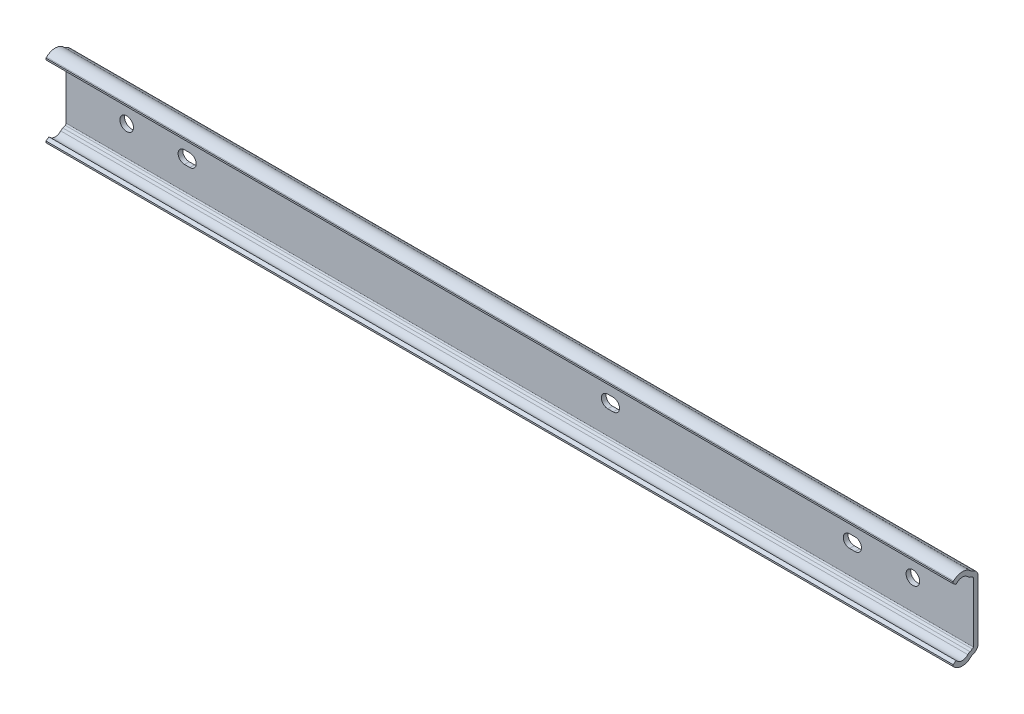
ISO-10303-21;
HEADER;
FILE_DESCRIPTION(('STEP AP214'),'2;1');
FILE_NAME('part.step','',(''),(''),'','','');
FILE_SCHEMA(('AUTOMOTIVE_DESIGN { 1 0 10303 214 1 1 1 1 }'));
ENDSEC;
DATA;
#1=APPLICATION_CONTEXT('core data for automotive mechanical design processes');
#2=APPLICATION_PROTOCOL_DEFINITION('international standard','automotive_design',2000,#1);
#3=PRODUCT_CONTEXT('',#1,'mechanical');
#4=PRODUCT('Part','Part','',(#3));
#5=PRODUCT_RELATED_PRODUCT_CATEGORY('part','',(#4));
#6=PRODUCT_DEFINITION_FORMATION('','',#4);
#7=PRODUCT_DEFINITION_CONTEXT('part definition',#1,'design');
#8=PRODUCT_DEFINITION('design','',#6,#7);
#9=PRODUCT_DEFINITION_SHAPE('','',#8);
#10=(LENGTH_UNIT() NAMED_UNIT(*) SI_UNIT(.MILLI.,.METRE.));
#11=(NAMED_UNIT(*) PLANE_ANGLE_UNIT() SI_UNIT($,.RADIAN.));
#12=(NAMED_UNIT(*) SI_UNIT($,.STERADIAN.) SOLID_ANGLE_UNIT());
#13=UNCERTAINTY_MEASURE_WITH_UNIT(LENGTH_MEASURE(1.E-05),#10,'distance_accuracy_value','');
#14=(GEOMETRIC_REPRESENTATION_CONTEXT(3) GLOBAL_UNCERTAINTY_ASSIGNED_CONTEXT((#13)) GLOBAL_UNIT_ASSIGNED_CONTEXT((#10,
#11,#12)) REPRESENTATION_CONTEXT('',''));
#15=CARTESIAN_POINT('',(0.,0.,0.));
#16=DIRECTION('',(0.,0.,1.));
#17=DIRECTION('',(1.,0.,0.));
#18=AXIS2_PLACEMENT_3D('',#15,#16,#17);
#19=CARTESIAN_POINT('',(-20.,9.85313395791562,1.54999999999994));
#20=DIRECTION('',(0.,0.,1.));
#21=DIRECTION('',(-1.,0.,0.));
#22=AXIS2_PLACEMENT_3D('',#19,#20,#21);
#23=PLANE('',#22);
#24=DIRECTION('',(0.,-1.,0.));
#25=VECTOR('',#24,1.);
#26=CARTESIAN_POINT('',(-20.,9.85313395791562,1.54999999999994));
#27=LINE('',#26,#25);
#28=CARTESIAN_POINT('',(-20.,9.85313395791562,1.54999999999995));
#29=VERTEX_POINT('',#28);
#30=CARTESIAN_POINT('',(-20.,-9.85313395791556,1.54999999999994));
#31=VERTEX_POINT('',#30);
#32=EDGE_CURVE('E510',#29,#31,#27,.T.);
#33=ORIENTED_EDGE('',*,*,#32,.T.);
#34=DIRECTION('',(1.,0.,0.));
#35=VECTOR('',#34,1.);
#36=CARTESIAN_POINT('',(-20.,-9.85313395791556,1.54999999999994));
#37=LINE('',#36,#35);
#38=CARTESIAN_POINT('',(280.,-9.85313395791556,1.54999999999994));
#39=VERTEX_POINT('',#38);
#40=EDGE_CURVE('E524',#31,#39,#37,.T.);
#41=ORIENTED_EDGE('',*,*,#40,.T.);
#42=DIRECTION('',(0.,-1.,0.));
#43=VECTOR('',#42,1.);
#44=CARTESIAN_POINT('',(280.,9.85313395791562,1.54999999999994));
#45=LINE('',#44,#43);
#46=CARTESIAN_POINT('',(280.,9.85313395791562,1.54999999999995));
#47=VERTEX_POINT('',#46);
#48=EDGE_CURVE('E435',#47,#39,#45,.T.);
#49=ORIENTED_EDGE('',*,*,#48,.F.);
#50=DIRECTION('',(1.,0.,0.));
#51=VECTOR('',#50,1.);
#52=CARTESIAN_POINT('',(-20.,9.85313395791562,1.54999999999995));
#53=LINE('',#52,#51);
#54=EDGE_CURVE('E526',#29,#47,#53,.T.);
#55=ORIENTED_EDGE('',*,*,#54,.F.);
#56=EDGE_LOOP('',(#33,#41,#49,#55));
#57=FACE_BOUND('',#56,.T.);
#58=CARTESIAN_POINT('',(20.9,0.,1.54999999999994));
#59=DIRECTION('',(0.,0.,1.));
#60=DIRECTION('',(-1.,0.,0.));
#61=AXIS2_PLACEMENT_3D('',#58,#59,#60);
#62=CIRCLE('',#61,2.1);
#63=CARTESIAN_POINT('',(20.9,-2.09999999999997,1.54999999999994));
#64=VERTEX_POINT('',#63);
#65=CARTESIAN_POINT('',(20.9,2.1,1.54999999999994));
#66=VERTEX_POINT('',#65);
#67=EDGE_CURVE('E31',#64,#66,#62,.T.);
#68=ORIENTED_EDGE('',*,*,#67,.F.);
#69=DIRECTION('',(1.,0.,0.));
#70=VECTOR('',#69,1.);
#71=CARTESIAN_POINT('',(20.9,-2.09999999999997,1.54999999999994));
#72=LINE('',#71,#70);
#73=CARTESIAN_POINT('',(19.1,-2.09999999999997,1.54999999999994));
#74=VERTEX_POINT('',#73);
#75=EDGE_CURVE('E277',#74,#64,#72,.T.);
#76=ORIENTED_EDGE('',*,*,#75,.F.);
#77=CARTESIAN_POINT('',(19.1,0.,1.54999999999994));
#78=DIRECTION('',(0.,0.,1.));
#79=DIRECTION('',(-1.,0.,0.));
#80=AXIS2_PLACEMENT_3D('',#77,#78,#79);
#81=CIRCLE('',#80,2.1);
#82=CARTESIAN_POINT('',(19.1,2.1,1.54999999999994));
#83=VERTEX_POINT('',#82);
#84=EDGE_CURVE('E262',#83,#74,#81,.T.);
#85=ORIENTED_EDGE('',*,*,#84,.F.);
#86=DIRECTION('',(-1.,0.,0.));
#87=VECTOR('',#86,1.);
#88=CARTESIAN_POINT('',(20.9,2.1,1.54999999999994));
#89=LINE('',#88,#87);
#90=EDGE_CURVE('E271',#66,#83,#89,.T.);
#91=ORIENTED_EDGE('',*,*,#90,.F.);
#92=EDGE_LOOP('',(#68,#76,#85,#91));
#93=FACE_BOUND('',#92,.T.);
#94=CARTESIAN_POINT('',(160.9,0.,1.54999999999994));
#95=DIRECTION('',(0.,0.,1.));
#96=DIRECTION('',(-1.,0.,0.));
#97=AXIS2_PLACEMENT_3D('',#94,#95,#96);
#98=CIRCLE('',#97,2.1);
#99=CARTESIAN_POINT('',(160.9,-2.09999999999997,1.54999999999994));
#100=VERTEX_POINT('',#99);
#101=CARTESIAN_POINT('',(160.9,2.10000000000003,1.54999999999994));
#102=VERTEX_POINT('',#101);
#103=EDGE_CURVE('E293',#100,#102,#98,.T.);
#104=ORIENTED_EDGE('',*,*,#103,.F.);
#105=DIRECTION('',(1.,0.,0.));
#106=VECTOR('',#105,1.);
#107=CARTESIAN_POINT('',(160.9,-2.09999999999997,1.54999999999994));
#108=LINE('',#107,#106);
#109=CARTESIAN_POINT('',(159.1,-2.09999999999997,1.54999999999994));
#110=VERTEX_POINT('',#109);
#111=EDGE_CURVE('E303',#110,#100,#108,.T.);
#112=ORIENTED_EDGE('',*,*,#111,.F.);
#113=CARTESIAN_POINT('',(159.1,0.,1.54999999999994));
#114=DIRECTION('',(0.,0.,1.));
#115=DIRECTION('',(-1.,0.,0.));
#116=AXIS2_PLACEMENT_3D('',#113,#114,#115);
#117=CIRCLE('',#116,2.1);
#118=CARTESIAN_POINT('',(159.1,2.10000000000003,1.54999999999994));
#119=VERTEX_POINT('',#118);
#120=EDGE_CURVE('E300',#119,#110,#117,.T.);
#121=ORIENTED_EDGE('',*,*,#120,.F.);
#122=DIRECTION('',(-1.,0.,0.));
#123=VECTOR('',#122,1.);
#124=CARTESIAN_POINT('',(160.9,2.10000000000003,1.54999999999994));
#125=LINE('',#124,#123);
#126=EDGE_CURVE('E297',#102,#119,#125,.T.);
#127=ORIENTED_EDGE('',*,*,#126,.F.);
#128=EDGE_LOOP('',(#104,#112,#121,#127));
#129=FACE_BOUND('',#128,.T.);
#130=CARTESIAN_POINT('',(260.,0.,1.54999999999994));
#131=DIRECTION('',(0.,0.,1.));
#132=DIRECTION('',(-1.,0.,0.));
#133=AXIS2_PLACEMENT_3D('',#130,#131,#132);
#134=CIRCLE('',#133,2.24999999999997);
#135=CARTESIAN_POINT('',(257.75,0.,1.54999999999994));
#136=VERTEX_POINT('',#135);
#137=EDGE_CURVE('E321',#136,#136,#134,.T.);
#138=ORIENTED_EDGE('',*,*,#137,.F.);
#139=EDGE_LOOP('',(#138));
#140=FACE_BOUND('',#139,.T.);
#141=CARTESIAN_POINT('',(0.,0.,1.54999999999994));
#142=DIRECTION('',(0.,0.,1.));
#143=DIRECTION('',(-1.,0.,0.));
#144=AXIS2_PLACEMENT_3D('',#141,#142,#143);
#145=CIRCLE('',#144,2.24999999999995);
#146=CARTESIAN_POINT('',(-2.24999999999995,0.,1.54999999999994));
#147=VERTEX_POINT('',#146);
#148=EDGE_CURVE('E333',#147,#147,#145,.T.);
#149=ORIENTED_EDGE('',*,*,#148,.F.);
#150=EDGE_LOOP('',(#149));
#151=FACE_BOUND('',#150,.T.);
#152=CARTESIAN_POINT('',(239.1,0.,1.54999999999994));
#153=DIRECTION('',(0.,0.,1.));
#154=DIRECTION('',(-1.,0.,0.));
#155=AXIS2_PLACEMENT_3D('',#152,#153,#154);
#156=CIRCLE('',#155,2.1);
#157=CARTESIAN_POINT('',(239.1,2.10000000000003,1.54999999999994));
#158=VERTEX_POINT('',#157);
#159=CARTESIAN_POINT('',(239.1,-2.09999999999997,1.54999999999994));
#160=VERTEX_POINT('',#159);
#161=EDGE_CURVE('E339',#158,#160,#156,.T.);
#162=ORIENTED_EDGE('',*,*,#161,.F.);
#163=DIRECTION('',(-1.,0.,0.));
#164=VECTOR('',#163,1.);
#165=CARTESIAN_POINT('',(240.9,2.10000000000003,1.54999999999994));
#166=LINE('',#165,#164);
#167=CARTESIAN_POINT('',(240.9,2.10000000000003,1.54999999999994));
#168=VERTEX_POINT('',#167);
#169=EDGE_CURVE('E347',#168,#158,#166,.T.);
#170=ORIENTED_EDGE('',*,*,#169,.F.);
#171=CARTESIAN_POINT('',(240.9,0.,1.54999999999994));
#172=DIRECTION('',(0.,0.,1.));
#173=DIRECTION('',(-1.,0.,0.));
#174=AXIS2_PLACEMENT_3D('',#171,#172,#173);
#175=CIRCLE('',#174,2.1);
#176=CARTESIAN_POINT('',(240.9,-2.09999999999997,1.54999999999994));
#177=VERTEX_POINT('',#176);
#178=EDGE_CURVE('E344',#177,#168,#175,.T.);
#179=ORIENTED_EDGE('',*,*,#178,.F.);
#180=DIRECTION('',(1.,0.,0.));
#181=VECTOR('',#180,1.);
#182=CARTESIAN_POINT('',(240.9,-2.09999999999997,1.54999999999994));
#183=LINE('',#182,#181);
#184=EDGE_CURVE('E341',#160,#177,#183,.T.);
#185=ORIENTED_EDGE('',*,*,#184,.F.);
#186=EDGE_LOOP('',(#162,#170,#179,#185));
#187=FACE_BOUND('',#186,.T.);
#188=ADVANCED_FACE('F14',(#57,#93,#129,#140,#151,#187),#23,.T.);
#189=CARTESIAN_POINT('',(-20.,9.85313395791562,0.));
#190=DIRECTION('',(0.,0.,-1.));
#191=DIRECTION('',(1.,0.,0.));
#192=AXIS2_PLACEMENT_3D('',#189,#190,#191);
#193=PLANE('',#192);
#194=DIRECTION('',(0.,1.,0.));
#195=VECTOR('',#194,1.);
#196=CARTESIAN_POINT('',(-20.,9.85313395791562,0.));
#197=LINE('',#196,#195);
#198=CARTESIAN_POINT('',(-20.,-9.85313395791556,0.));
#199=VERTEX_POINT('',#198);
#200=CARTESIAN_POINT('',(-20.,9.85313395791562,0.));
#201=VERTEX_POINT('',#200);
#202=EDGE_CURVE('E473',#199,#201,#197,.T.);
#203=ORIENTED_EDGE('',*,*,#202,.T.);
#204=DIRECTION('',(1.,0.,0.));
#205=VECTOR('',#204,1.);
#206=CARTESIAN_POINT('',(-20.,9.85313395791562,0.));
#207=LINE('',#206,#205);
#208=CARTESIAN_POINT('',(280.,9.85313395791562,0.));
#209=VERTEX_POINT('',#208);
#210=EDGE_CURVE('E551',#201,#209,#207,.T.);
#211=ORIENTED_EDGE('',*,*,#210,.T.);
#212=DIRECTION('',(0.,1.,0.));
#213=VECTOR('',#212,1.);
#214=CARTESIAN_POINT('',(280.,9.85313395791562,0.));
#215=LINE('',#214,#213);
#216=CARTESIAN_POINT('',(280.,-9.85313395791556,0.));
#217=VERTEX_POINT('',#216);
#218=EDGE_CURVE('E397',#217,#209,#215,.T.);
#219=ORIENTED_EDGE('',*,*,#218,.F.);
#220=DIRECTION('',(1.,0.,0.));
#221=VECTOR('',#220,1.);
#222=CARTESIAN_POINT('',(-20.,-9.85313395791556,0.));
#223=LINE('',#222,#221);
#224=EDGE_CURVE('E553',#199,#217,#223,.T.);
#225=ORIENTED_EDGE('',*,*,#224,.F.);
#226=EDGE_LOOP('',(#203,#211,#219,#225));
#227=FACE_BOUND('',#226,.T.);
#228=CARTESIAN_POINT('',(20.9,0.,0.));
#229=DIRECTION('',(0.,0.,1.));
#230=DIRECTION('',(-1.,0.,0.));
#231=AXIS2_PLACEMENT_3D('',#228,#229,#230);
#232=CIRCLE('',#231,2.1);
#233=CARTESIAN_POINT('',(20.9,-2.09999999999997,0.));
#234=VERTEX_POINT('',#233);
#235=CARTESIAN_POINT('',(20.9,2.1,0.));
#236=VERTEX_POINT('',#235);
#237=EDGE_CURVE('E279',#234,#236,#232,.T.);
#238=ORIENTED_EDGE('',*,*,#237,.T.);
#239=DIRECTION('',(-1.,0.,0.));
#240=VECTOR('',#239,1.);
#241=CARTESIAN_POINT('',(20.9,2.1,0.));
#242=LINE('',#241,#240);
#243=CARTESIAN_POINT('',(19.1,2.1,0.));
#244=VERTEX_POINT('',#243);
#245=EDGE_CURVE('E285',#236,#244,#242,.T.);
#246=ORIENTED_EDGE('',*,*,#245,.T.);
#247=CARTESIAN_POINT('',(19.1,0.,0.));
#248=DIRECTION('',(0.,0.,1.));
#249=DIRECTION('',(-1.,0.,0.));
#250=AXIS2_PLACEMENT_3D('',#247,#248,#249);
#251=CIRCLE('',#250,2.1);
#252=CARTESIAN_POINT('',(19.1,-2.09999999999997,0.));
#253=VERTEX_POINT('',#252);
#254=EDGE_CURVE('E39',#244,#253,#251,.T.);
#255=ORIENTED_EDGE('',*,*,#254,.T.);
#256=DIRECTION('',(1.,0.,0.));
#257=VECTOR('',#256,1.);
#258=CARTESIAN_POINT('',(20.9,-2.09999999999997,0.));
#259=LINE('',#258,#257);
#260=EDGE_CURVE('E288',#253,#234,#259,.T.);
#261=ORIENTED_EDGE('',*,*,#260,.T.);
#262=EDGE_LOOP('',(#238,#246,#255,#261));
#263=FACE_BOUND('',#262,.T.);
#264=CARTESIAN_POINT('',(160.9,0.,0.));
#265=DIRECTION('',(0.,0.,1.));
#266=DIRECTION('',(-1.,0.,0.));
#267=AXIS2_PLACEMENT_3D('',#264,#265,#266);
#268=CIRCLE('',#267,2.1);
#269=CARTESIAN_POINT('',(160.9,-2.09999999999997,0.));
#270=VERTEX_POINT('',#269);
#271=CARTESIAN_POINT('',(160.9,2.10000000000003,0.));
#272=VERTEX_POINT('',#271);
#273=EDGE_CURVE('E306',#270,#272,#268,.T.);
#274=ORIENTED_EDGE('',*,*,#273,.T.);
#275=DIRECTION('',(-1.,0.,0.));
#276=VECTOR('',#275,1.);
#277=CARTESIAN_POINT('',(160.9,2.10000000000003,0.));
#278=LINE('',#277,#276);
#279=CARTESIAN_POINT('',(159.1,2.10000000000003,0.));
#280=VERTEX_POINT('',#279);
#281=EDGE_CURVE('E309',#272,#280,#278,.T.);
#282=ORIENTED_EDGE('',*,*,#281,.T.);
#283=CARTESIAN_POINT('',(159.1,0.,0.));
#284=DIRECTION('',(0.,0.,1.));
#285=DIRECTION('',(-1.,0.,0.));
#286=AXIS2_PLACEMENT_3D('',#283,#284,#285);
#287=CIRCLE('',#286,2.1);
#288=CARTESIAN_POINT('',(159.1,-2.09999999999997,0.));
#289=VERTEX_POINT('',#288);
#290=EDGE_CURVE('E312',#280,#289,#287,.T.);
#291=ORIENTED_EDGE('',*,*,#290,.T.);
#292=DIRECTION('',(1.,0.,0.));
#293=VECTOR('',#292,1.);
#294=CARTESIAN_POINT('',(160.9,-2.09999999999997,0.));
#295=LINE('',#294,#293);
#296=EDGE_CURVE('E315',#289,#270,#295,.T.);
#297=ORIENTED_EDGE('',*,*,#296,.T.);
#298=EDGE_LOOP('',(#274,#282,#291,#297));
#299=FACE_BOUND('',#298,.T.);
#300=CARTESIAN_POINT('',(260.,0.,0.));
#301=DIRECTION('',(0.,0.,1.));
#302=DIRECTION('',(-1.,0.,0.));
#303=AXIS2_PLACEMENT_3D('',#300,#301,#302);
#304=CIRCLE('',#303,2.24999999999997);
#305=CARTESIAN_POINT('',(257.75,0.,0.));
#306=VERTEX_POINT('',#305);
#307=EDGE_CURVE('E330',#306,#306,#304,.T.);
#308=ORIENTED_EDGE('',*,*,#307,.T.);
#309=EDGE_LOOP('',(#308));
#310=FACE_BOUND('',#309,.T.);
#311=CARTESIAN_POINT('',(0.,0.,0.));
#312=DIRECTION('',(0.,0.,1.));
#313=DIRECTION('',(-1.,0.,0.));
#314=AXIS2_PLACEMENT_3D('',#311,#312,#313);
#315=CIRCLE('',#314,2.24999999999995);
#316=CARTESIAN_POINT('',(-2.24999999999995,0.,0.));
#317=VERTEX_POINT('',#316);
#318=EDGE_CURVE('E336',#317,#317,#315,.T.);
#319=ORIENTED_EDGE('',*,*,#318,.T.);
#320=EDGE_LOOP('',(#319));
#321=FACE_BOUND('',#320,.T.);
#322=CARTESIAN_POINT('',(239.1,0.,0.));
#323=DIRECTION('',(0.,0.,1.));
#324=DIRECTION('',(-1.,0.,0.));
#325=AXIS2_PLACEMENT_3D('',#322,#323,#324);
#326=CIRCLE('',#325,2.1);
#327=CARTESIAN_POINT('',(239.1,2.10000000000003,0.));
#328=VERTEX_POINT('',#327);
#329=CARTESIAN_POINT('',(239.1,-2.09999999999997,0.));
#330=VERTEX_POINT('',#329);
#331=EDGE_CURVE('E350',#328,#330,#326,.T.);
#332=ORIENTED_EDGE('',*,*,#331,.T.);
#333=DIRECTION('',(1.,0.,0.));
#334=VECTOR('',#333,1.);
#335=CARTESIAN_POINT('',(240.9,-2.09999999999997,0.));
#336=LINE('',#335,#334);
#337=CARTESIAN_POINT('',(240.9,-2.09999999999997,0.));
#338=VERTEX_POINT('',#337);
#339=EDGE_CURVE('E353',#330,#338,#336,.T.);
#340=ORIENTED_EDGE('',*,*,#339,.T.);
#341=CARTESIAN_POINT('',(240.9,0.,0.));
#342=DIRECTION('',(0.,0.,1.));
#343=DIRECTION('',(-1.,0.,0.));
#344=AXIS2_PLACEMENT_3D('',#341,#342,#343);
#345=CIRCLE('',#344,2.1);
#346=CARTESIAN_POINT('',(240.9,2.10000000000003,0.));
#347=VERTEX_POINT('',#346);
#348=EDGE_CURVE('E356',#338,#347,#345,.T.);
#349=ORIENTED_EDGE('',*,*,#348,.T.);
#350=DIRECTION('',(-1.,0.,0.));
#351=VECTOR('',#350,1.);
#352=CARTESIAN_POINT('',(240.9,2.10000000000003,0.));
#353=LINE('',#352,#351);
#354=EDGE_CURVE('E359',#347,#328,#353,.T.);
#355=ORIENTED_EDGE('',*,*,#354,.T.);
#356=EDGE_LOOP('',(#332,#340,#349,#355));
#357=FACE_BOUND('',#356,.T.);
#358=ADVANCED_FACE('F618',(#227,#263,#299,#310,#321,#357),#193,.T.);
#359=CARTESIAN_POINT('',(-20.,-9.46999976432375,5.19000022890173));
#360=DIRECTION('',(1.,0.,0.));
#361=DIRECTION('',(0.,0.,1.));
#362=AXIS2_PLACEMENT_3D('',#359,#360,#361);
#363=CYLINDRICAL_SURFACE('',#362,2.47999999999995);
#364=CARTESIAN_POINT('',(280.,-9.46999976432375,5.19000022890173));
#365=DIRECTION('',(-1.,0.,0.));
#366=DIRECTION('',(0.,0.,1.));
#367=AXIS2_PLACEMENT_3D('',#364,#365,#366);
#368=CIRCLE('',#367,2.47999999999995);
#369=CARTESIAN_POINT('',(280.,-11.1527317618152,3.3682392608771));
#370=VERTEX_POINT('',#369);
#371=CARTESIAN_POINT('',(280.,-11.2236245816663,6.94362504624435));
#372=VERTEX_POINT('',#371);
#373=EDGE_CURVE('E365',#370,#372,#368,.T.);
#374=ORIENTED_EDGE('',*,*,#373,.F.);
#375=DIRECTION('',(1.,0.,0.));
#376=VECTOR('',#375,1.);
#377=CARTESIAN_POINT('',(-20.,-11.1527317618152,3.3682392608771));
#378=LINE('',#377,#376);
#379=CARTESIAN_POINT('',(-20.,-11.1527317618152,3.3682392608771));
#380=VERTEX_POINT('',#379);
#381=EDGE_CURVE('E9',#380,#370,#378,.T.);
#382=ORIENTED_EDGE('',*,*,#381,.F.);
#383=CARTESIAN_POINT('',(-20.,-9.46999976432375,5.19000022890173));
#384=DIRECTION('',(-1.,0.,0.));
#385=DIRECTION('',(0.,0.,1.));
#386=AXIS2_PLACEMENT_3D('',#383,#384,#385);
#387=CIRCLE('',#386,2.47999999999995);
#388=CARTESIAN_POINT('',(-20.,-11.2236245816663,6.94362504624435));
#389=VERTEX_POINT('',#388);
#390=EDGE_CURVE('E447',#380,#389,#387,.T.);
#391=ORIENTED_EDGE('',*,*,#390,.T.);
#392=DIRECTION('',(1.,0.,0.));
#393=VECTOR('',#392,1.);
#394=CARTESIAN_POINT('',(-20.,-11.2236245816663,6.94362504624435));
#395=LINE('',#394,#393);
#396=EDGE_CURVE('E18',#389,#372,#395,.T.);
#397=ORIENTED_EDGE('',*,*,#396,.T.);
#398=EDGE_LOOP('',(#374,#382,#391,#397));
#399=FACE_BOUND('',#398,.T.);
#400=ADVANCED_FACE('F16',(#399),#363,.F.);
#401=CARTESIAN_POINT('',(-20.,-12.5436997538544,1.86234824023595));
#402=DIRECTION('',(1.,0.,0.));
#403=DIRECTION('',(0.,0.,1.));
#404=AXIS2_PLACEMENT_3D('',#401,#402,#403);
#405=CYLINDRICAL_SURFACE('',#404,2.04999993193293);
#406=CARTESIAN_POINT('',(280.,-12.5436997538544,1.86234824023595));
#407=DIRECTION('',(1.,0.,0.));
#408=DIRECTION('',(0.,0.,1.));
#409=AXIS2_PLACEMENT_3D('',#406,#407,#408);
#410=CIRCLE('',#409,2.04999993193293);
#411=CARTESIAN_POINT('',(280.,-10.6566648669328,2.66334702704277));
#412=VERTEX_POINT('',#411);
#413=EDGE_CURVE('E444',#412,#370,#410,.T.);
#414=ORIENTED_EDGE('',*,*,#413,.F.);
#415=DIRECTION('',(1.,0.,0.));
#416=VECTOR('',#415,1.);
#417=CARTESIAN_POINT('',(-20.,-10.6566648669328,2.66334702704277));
#418=LINE('',#417,#416);
#419=CARTESIAN_POINT('',(-20.,-10.6566648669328,2.66334702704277));
#420=VERTEX_POINT('',#419);
#421=EDGE_CURVE('E23',#420,#412,#418,.T.);
#422=ORIENTED_EDGE('',*,*,#421,.F.);
#423=CARTESIAN_POINT('',(-20.,-12.5436997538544,1.86234824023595));
#424=DIRECTION('',(1.,0.,0.));
#425=DIRECTION('',(0.,0.,1.));
#426=AXIS2_PLACEMENT_3D('',#423,#424,#425);
#427=CIRCLE('',#426,2.04999993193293);
#428=EDGE_CURVE('E518',#420,#380,#427,.T.);
#429=ORIENTED_EDGE('',*,*,#428,.T.);
#430=ORIENTED_EDGE('',*,*,#381,.T.);
#431=EDGE_LOOP('',(#414,#422,#429,#430));
#432=FACE_BOUND('',#431,.T.);
#433=ADVANCED_FACE('F581',(#432),#405,.T.);
#434=CARTESIAN_POINT('',(-20.,-10.6566648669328,2.66334702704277));
#435=DIRECTION('',(0.,0.920504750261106,0.390731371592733));
#436=DIRECTION('',(0.,-0.390731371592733,0.920504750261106));
#437=AXIS2_PLACEMENT_3D('',#434,#435,#436);
#438=PLANE('',#437);
#439=DIRECTION('',(0.,-0.390731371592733,0.920504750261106));
#440=VECTOR('',#439,1.);
#441=CARTESIAN_POINT('',(280.,-10.6566648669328,2.66334702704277));
#442=LINE('',#441,#440);
#443=CARTESIAN_POINT('',(280.,-10.3133868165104,1.85463521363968));
#444=VERTEX_POINT('',#443);
#445=EDGE_CURVE('E441',#444,#412,#442,.T.);
#446=ORIENTED_EDGE('',*,*,#445,.F.);
#447=DIRECTION('',(1.,0.,0.));
#448=VECTOR('',#447,1.);
#449=CARTESIAN_POINT('',(-20.,-10.3133868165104,1.85463521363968));
#450=LINE('',#449,#448);
#451=CARTESIAN_POINT('',(-20.,-10.3133868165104,1.85463521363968));
#452=VERTEX_POINT('',#451);
#453=EDGE_CURVE('E522',#452,#444,#450,.T.);
#454=ORIENTED_EDGE('',*,*,#453,.F.);
#455=DIRECTION('',(0.,-0.390731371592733,0.920504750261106));
#456=VECTOR('',#455,1.);
#457=CARTESIAN_POINT('',(-20.,-10.6566648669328,2.66334702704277));
#458=LINE('',#457,#456);
#459=EDGE_CURVE('E515',#452,#420,#458,.T.);
#460=ORIENTED_EDGE('',*,*,#459,.T.);
#461=ORIENTED_EDGE('',*,*,#421,.T.);
#462=EDGE_LOOP('',(#446,#454,#460,#461));
#463=FACE_BOUND('',#462,.T.);
#464=ADVANCED_FACE('F678',(#463),#438,.T.);
#465=CARTESIAN_POINT('',(-20.,-9.85313395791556,2.05000015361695));
#466=DIRECTION('',(1.,0.,0.));
#467=DIRECTION('',(0.,0.,1.));
#468=AXIS2_PLACEMENT_3D('',#465,#466,#467);
#469=CYLINDRICAL_SURFACE('',#468,0.500000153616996);
#470=CARTESIAN_POINT('',(280.,-9.85313395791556,2.05000015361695));
#471=DIRECTION('',(-1.,0.,0.));
#472=DIRECTION('',(0.,0.,1.));
#473=AXIS2_PLACEMENT_3D('',#470,#471,#472);
#474=CIRCLE('',#473,0.500000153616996);
#475=EDGE_CURVE('E438',#39,#444,#474,.T.);
#476=ORIENTED_EDGE('',*,*,#475,.F.);
#477=ORIENTED_EDGE('',*,*,#40,.F.);
#478=CARTESIAN_POINT('',(-20.,-9.85313395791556,2.05000015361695));
#479=DIRECTION('',(-1.,0.,0.));
#480=DIRECTION('',(0.,0.,1.));
#481=AXIS2_PLACEMENT_3D('',#478,#479,#480);
#482=CIRCLE('',#481,0.500000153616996);
#483=EDGE_CURVE('E512',#31,#452,#482,.T.);
#484=ORIENTED_EDGE('',*,*,#483,.T.);
#485=ORIENTED_EDGE('',*,*,#453,.T.);
#486=EDGE_LOOP('',(#476,#477,#484,#485));
#487=FACE_BOUND('',#486,.T.);
#488=ADVANCED_FACE('F676',(#487),#469,.F.);
#489=CARTESIAN_POINT('',(-20.,9.85313395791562,2.05000015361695));
#490=DIRECTION('',(1.,0.,0.));
#491=DIRECTION('',(0.,0.,1.));
#492=AXIS2_PLACEMENT_3D('',#489,#490,#491);
#493=CYLINDRICAL_SURFACE('',#492,0.500000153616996);
#494=CARTESIAN_POINT('',(280.,9.85313395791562,2.05000015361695));
#495=DIRECTION('',(-1.,0.,0.));
#496=DIRECTION('',(0.,0.,-1.));
#497=AXIS2_PLACEMENT_3D('',#494,#495,#496);
#498=CIRCLE('',#497,0.500000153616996);
#499=CARTESIAN_POINT('',(280.,10.3133868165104,1.85463521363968));
#500=VERTEX_POINT('',#499);
#501=EDGE_CURVE('E432',#500,#47,#498,.T.);
#502=ORIENTED_EDGE('',*,*,#501,.F.);
#503=DIRECTION('',(1.,0.,0.));
#504=VECTOR('',#503,1.);
#505=CARTESIAN_POINT('',(-20.,10.3133868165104,1.85463521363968));
#506=LINE('',#505,#504);
#507=CARTESIAN_POINT('',(-20.,10.3133868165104,1.85463521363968));
#508=VERTEX_POINT('',#507);
#509=EDGE_CURVE('E528',#508,#500,#506,.T.);
#510=ORIENTED_EDGE('',*,*,#509,.F.);
#511=CARTESIAN_POINT('',(-20.,9.85313395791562,2.05000015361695));
#512=DIRECTION('',(-1.,0.,0.));
#513=DIRECTION('',(0.,0.,-1.));
#514=AXIS2_PLACEMENT_3D('',#511,#512,#513);
#515=CIRCLE('',#514,0.500000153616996);
#516=EDGE_CURVE('E507',#508,#29,#515,.T.);
#517=ORIENTED_EDGE('',*,*,#516,.T.);
#518=ORIENTED_EDGE('',*,*,#54,.T.);
#519=EDGE_LOOP('',(#502,#510,#517,#518));
#520=FACE_BOUND('',#519,.T.);
#521=ADVANCED_FACE('F668',(#520),#493,.F.);
#522=CARTESIAN_POINT('',(-20.,10.6566648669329,2.66334702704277));
#523=DIRECTION('',(0.,-0.920504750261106,0.390731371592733));
#524=DIRECTION('',(0.,-0.390731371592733,-0.920504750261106));
#525=AXIS2_PLACEMENT_3D('',#522,#523,#524);
#526=PLANE('',#525);
#527=DIRECTION('',(0.,-0.390731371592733,-0.920504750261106));
#528=VECTOR('',#527,1.);
#529=CARTESIAN_POINT('',(280.,10.6566648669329,2.66334702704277));
#530=LINE('',#529,#528);
#531=CARTESIAN_POINT('',(280.,10.6566648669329,2.66334702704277));
#532=VERTEX_POINT('',#531);
#533=EDGE_CURVE('E429',#532,#500,#530,.T.);
#534=ORIENTED_EDGE('',*,*,#533,.F.);
#535=DIRECTION('',(1.,0.,0.));
#536=VECTOR('',#535,1.);
#537=CARTESIAN_POINT('',(-20.,10.6566648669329,2.66334702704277));
#538=LINE('',#537,#536);
#539=CARTESIAN_POINT('',(-20.,10.6566648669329,2.66334702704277));
#540=VERTEX_POINT('',#539);
#541=EDGE_CURVE('E530',#540,#532,#538,.T.);
#542=ORIENTED_EDGE('',*,*,#541,.F.);
#543=DIRECTION('',(0.,-0.390731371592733,-0.920504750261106));
#544=VECTOR('',#543,1.);
#545=CARTESIAN_POINT('',(-20.,10.6566648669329,2.66334702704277));
#546=LINE('',#545,#544);
#547=EDGE_CURVE('E504',#540,#508,#546,.T.);
#548=ORIENTED_EDGE('',*,*,#547,.T.);
#549=ORIENTED_EDGE('',*,*,#509,.T.);
#550=EDGE_LOOP('',(#534,#542,#548,#549));
#551=FACE_BOUND('',#550,.T.);
#552=ADVANCED_FACE('F664',(#551),#526,.T.);
#553=CARTESIAN_POINT('',(-20.,12.5436997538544,1.86234824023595));
#554=DIRECTION('',(1.,0.,0.));
#555=DIRECTION('',(0.,0.,1.));
#556=AXIS2_PLACEMENT_3D('',#553,#554,#555);
#557=CYLINDRICAL_SURFACE('',#556,2.04999993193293);
#558=CARTESIAN_POINT('',(280.,12.5436997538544,1.86234824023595));
#559=DIRECTION('',(1.,0.,0.));
#560=DIRECTION('',(0.,0.,-1.));
#561=AXIS2_PLACEMENT_3D('',#558,#559,#560);
#562=CIRCLE('',#561,2.04999993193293);
#563=CARTESIAN_POINT('',(280.,11.1527317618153,3.36823926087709));
#564=VERTEX_POINT('',#563);
#565=EDGE_CURVE('E426',#564,#532,#562,.T.);
#566=ORIENTED_EDGE('',*,*,#565,.F.);
#567=DIRECTION('',(1.,0.,0.));
#568=VECTOR('',#567,1.);
#569=CARTESIAN_POINT('',(-20.,11.1527317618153,3.36823926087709));
#570=LINE('',#569,#568);
#571=CARTESIAN_POINT('',(-20.,11.1527317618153,3.36823926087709));
#572=VERTEX_POINT('',#571);
#573=EDGE_CURVE('E532',#572,#564,#570,.T.);
#574=ORIENTED_EDGE('',*,*,#573,.F.);
#575=CARTESIAN_POINT('',(-20.,12.5436997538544,1.86234824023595));
#576=DIRECTION('',(1.,0.,0.));
#577=DIRECTION('',(0.,0.,-1.));
#578=AXIS2_PLACEMENT_3D('',#575,#576,#577);
#579=CIRCLE('',#578,2.04999993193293);
#580=EDGE_CURVE('E501',#572,#540,#579,.T.);
#581=ORIENTED_EDGE('',*,*,#580,.T.);
#582=ORIENTED_EDGE('',*,*,#541,.T.);
#583=EDGE_LOOP('',(#566,#574,#581,#582));
#584=FACE_BOUND('',#583,.T.);
#585=ADVANCED_FACE('F660',(#584),#557,.T.);
#586=CARTESIAN_POINT('',(-20.,9.46999976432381,5.19000022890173));
#587=DIRECTION('',(1.,0.,0.));
#588=DIRECTION('',(0.,0.,1.));
#589=AXIS2_PLACEMENT_3D('',#586,#587,#588);
#590=CYLINDRICAL_SURFACE('',#589,2.47999999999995);
#591=CARTESIAN_POINT('',(280.,9.46999976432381,5.19000022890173));
#592=DIRECTION('',(-1.,0.,0.));
#593=DIRECTION('',(0.,0.,-1.));
#594=AXIS2_PLACEMENT_3D('',#591,#592,#593);
#595=CIRCLE('',#594,2.47999999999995);
#596=CARTESIAN_POINT('',(280.,11.2236245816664,6.94362504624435));
#597=VERTEX_POINT('',#596);
#598=EDGE_CURVE('E423',#597,#564,#595,.T.);
#599=ORIENTED_EDGE('',*,*,#598,.F.);
#600=DIRECTION('',(1.,0.,0.));
#601=VECTOR('',#600,1.);
#602=CARTESIAN_POINT('',(-20.,11.2236245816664,6.94362504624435));
#603=LINE('',#602,#601);
#604=CARTESIAN_POINT('',(-20.,11.2236245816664,6.94362504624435));
#605=VERTEX_POINT('',#604);
#606=EDGE_CURVE('E534',#605,#597,#603,.T.);
#607=ORIENTED_EDGE('',*,*,#606,.F.);
#608=CARTESIAN_POINT('',(-20.,9.46999976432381,5.19000022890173));
#609=DIRECTION('',(-1.,0.,0.));
#610=DIRECTION('',(0.,0.,-1.));
#611=AXIS2_PLACEMENT_3D('',#608,#609,#610);
#612=CIRCLE('',#611,2.47999999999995);
#613=EDGE_CURVE('E498',#605,#572,#612,.T.);
#614=ORIENTED_EDGE('',*,*,#613,.T.);
#615=ORIENTED_EDGE('',*,*,#573,.T.);
#616=EDGE_LOOP('',(#599,#607,#614,#615));
#617=FACE_BOUND('',#616,.T.);
#618=ADVANCED_FACE('F656',(#617),#590,.F.);
#619=CARTESIAN_POINT('',(-20.,11.2236245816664,6.94362504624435));
#620=DIRECTION('',(0.,-0.707107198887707,-0.707106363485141));
#621=DIRECTION('',(0.,0.707106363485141,-0.707107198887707));
#622=AXIS2_PLACEMENT_3D('',#619,#620,#621);
#623=PLANE('',#622);
#624=DIRECTION('',(0.,0.707106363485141,-0.707107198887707));
#625=VECTOR('',#624,1.);
#626=CARTESIAN_POINT('',(280.,11.2236245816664,6.94362504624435));
#627=LINE('',#626,#625);
#628=CARTESIAN_POINT('',(280.,10.9144127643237,7.25283722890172));
#629=VERTEX_POINT('',#628);
#630=EDGE_CURVE('E420',#629,#597,#627,.T.);
#631=ORIENTED_EDGE('',*,*,#630,.F.);
#632=DIRECTION('',(1.,0.,0.));
#633=VECTOR('',#632,1.);
#634=CARTESIAN_POINT('',(-20.,10.9144127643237,7.25283722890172));
#635=LINE('',#634,#633);
#636=CARTESIAN_POINT('',(-20.,10.9144127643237,7.25283722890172));
#637=VERTEX_POINT('',#636);
#638=EDGE_CURVE('E536',#637,#629,#635,.T.);
#639=ORIENTED_EDGE('',*,*,#638,.F.);
#640=DIRECTION('',(0.,0.707106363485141,-0.707107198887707));
#641=VECTOR('',#640,1.);
#642=CARTESIAN_POINT('',(-20.,11.2236245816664,6.94362504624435));
#643=LINE('',#642,#641);
#644=EDGE_CURVE('E495',#637,#605,#643,.T.);
#645=ORIENTED_EDGE('',*,*,#644,.T.);
#646=ORIENTED_EDGE('',*,*,#606,.T.);
#647=EDGE_LOOP('',(#631,#639,#645,#646));
#648=FACE_BOUND('',#647,.T.);
#649=ADVANCED_FACE('F652',(#648),#623,.T.);
#650=CARTESIAN_POINT('',(-20.,10.9144127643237,7.25283722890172));
#651=DIRECTION('',(0.,-0.819151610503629,0.573577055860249));
#652=DIRECTION('',(0.,-0.573577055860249,-0.819151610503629));
#653=AXIS2_PLACEMENT_3D('',#650,#651,#652);
#654=PLANE('',#653);
#655=DIRECTION('',(0.,-0.573577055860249,-0.819151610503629));
#656=VECTOR('',#655,1.);
#657=CARTESIAN_POINT('',(280.,10.9144127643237,7.25283722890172));
#658=LINE('',#657,#656);
#659=CARTESIAN_POINT('',(280.,11.5986307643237,8.23000022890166));
#660=VERTEX_POINT('',#659);
#661=EDGE_CURVE('E417',#660,#629,#658,.T.);
#662=ORIENTED_EDGE('',*,*,#661,.F.);
#663=DIRECTION('',(1.,0.,0.));
#664=VECTOR('',#663,1.);
#665=CARTESIAN_POINT('',(-20.,11.5986307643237,8.23000022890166));
#666=LINE('',#665,#664);
#667=CARTESIAN_POINT('',(-20.,11.5986307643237,8.23000022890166));
#668=VERTEX_POINT('',#667);
#669=EDGE_CURVE('E538',#668,#660,#666,.T.);
#670=ORIENTED_EDGE('',*,*,#669,.F.);
#671=DIRECTION('',(0.,-0.573577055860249,-0.819151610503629));
#672=VECTOR('',#671,1.);
#673=CARTESIAN_POINT('',(-20.,10.9144127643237,7.25283722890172));
#674=LINE('',#673,#672);
#675=EDGE_CURVE('E492',#668,#637,#674,.T.);
#676=ORIENTED_EDGE('',*,*,#675,.T.);
#677=ORIENTED_EDGE('',*,*,#638,.T.);
#678=EDGE_LOOP('',(#662,#670,#676,#677));
#679=FACE_BOUND('',#678,.T.);
#680=ADVANCED_FACE('F648',(#679),#654,.T.);
#681=CARTESIAN_POINT('',(-20.,12.1292794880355,8.22999995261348));
#682=DIRECTION('',(0.,5.20661172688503E-07,0.999999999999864));
#683=DIRECTION('',(0.,-0.999999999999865,5.20661172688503E-07));
#684=AXIS2_PLACEMENT_3D('',#681,#682,#683);
#685=PLANE('',#684);
#686=DIRECTION('',(0.,-0.999999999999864,5.20661172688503E-07));
#687=VECTOR('',#686,1.);
#688=CARTESIAN_POINT('',(280.,12.1292794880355,8.22999995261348));
#689=LINE('',#688,#687);
#690=CARTESIAN_POINT('',(280.,12.1292794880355,8.22999995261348));
#691=VERTEX_POINT('',#690);
#692=EDGE_CURVE('E414',#691,#660,#689,.T.);
#693=ORIENTED_EDGE('',*,*,#692,.F.);
#694=DIRECTION('',(1.,0.,0.));
#695=VECTOR('',#694,1.);
#696=CARTESIAN_POINT('',(-20.,12.1292794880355,8.22999995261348));
#697=LINE('',#696,#695);
#698=CARTESIAN_POINT('',(-20.,12.1292794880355,8.22999995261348));
#699=VERTEX_POINT('',#698);
#700=EDGE_CURVE('E540',#699,#691,#697,.T.);
#701=ORIENTED_EDGE('',*,*,#700,.F.);
#702=DIRECTION('',(0.,-0.999999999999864,5.20661172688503E-07));
#703=VECTOR('',#702,1.);
#704=CARTESIAN_POINT('',(-20.,12.1292794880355,8.22999995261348));
#705=LINE('',#704,#703);
#706=EDGE_CURVE('E489',#699,#668,#705,.T.);
#707=ORIENTED_EDGE('',*,*,#706,.T.);
#708=ORIENTED_EDGE('',*,*,#669,.T.);
#709=EDGE_LOOP('',(#693,#701,#707,#708));
#710=FACE_BOUND('',#709,.T.);
#711=ADVANCED_FACE('F644',(#710),#685,.T.);
#712=CARTESIAN_POINT('',(-20.,12.3196398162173,8.03964028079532));
#713=DIRECTION('',(0.,0.70710556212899,0.707108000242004));
#714=DIRECTION('',(0.,-0.707108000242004,0.70710556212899));
#715=AXIS2_PLACEMENT_3D('',#712,#713,#714);
#716=PLANE('',#715);
#717=DIRECTION('',(0.,-0.707108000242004,0.70710556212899));
#718=VECTOR('',#717,1.);
#719=CARTESIAN_POINT('',(280.,12.3196398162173,8.03964028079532));
#720=LINE('',#719,#718);
#721=CARTESIAN_POINT('',(280.,12.3196398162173,8.03964028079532));
#722=VERTEX_POINT('',#721);
#723=EDGE_CURVE('E411',#722,#691,#720,.T.);
#724=ORIENTED_EDGE('',*,*,#723,.F.);
#725=DIRECTION('',(1.,0.,0.));
#726=VECTOR('',#725,1.);
#727=CARTESIAN_POINT('',(-20.,12.3196398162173,8.03964028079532));
#728=LINE('',#727,#726);
#729=CARTESIAN_POINT('',(-20.,12.3196398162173,8.03964028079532));
#730=VERTEX_POINT('',#729);
#731=EDGE_CURVE('E542',#730,#722,#728,.T.);
#732=ORIENTED_EDGE('',*,*,#731,.F.);
#733=DIRECTION('',(0.,-0.707108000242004,0.70710556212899));
#734=VECTOR('',#733,1.);
#735=CARTESIAN_POINT('',(-20.,12.3196398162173,8.03964028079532));
#736=LINE('',#735,#734);
#737=EDGE_CURVE('E486',#730,#699,#736,.T.);
#738=ORIENTED_EDGE('',*,*,#737,.T.);
#739=ORIENTED_EDGE('',*,*,#700,.T.);
#740=EDGE_LOOP('',(#724,#732,#738,#739));
#741=FACE_BOUND('',#740,.T.);
#742=ADVANCED_FACE('F640',(#741),#716,.T.);
#743=CARTESIAN_POINT('',(-20.,9.46999976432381,5.19000022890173));
#744=DIRECTION('',(1.,0.,0.));
#745=DIRECTION('',(0.,0.,1.));
#746=AXIS2_PLACEMENT_3D('',#743,#744,#745);
#747=CYLINDRICAL_SURFACE('',#746,4.02999960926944);
#748=CARTESIAN_POINT('',(280.,9.46999976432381,5.19000022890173));
#749=DIRECTION('',(1.,0.,0.));
#750=DIRECTION('',(0.,0.,-1.));
#751=AXIS2_PLACEMENT_3D('',#748,#749,#750);
#752=CIRCLE('',#751,4.02999960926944);
#753=CARTESIAN_POINT('',(280.,12.2044389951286,2.22963894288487));
#754=VERTEX_POINT('',#753);
#755=EDGE_CURVE('E408',#754,#722,#752,.T.);
#756=ORIENTED_EDGE('',*,*,#755,.F.);
#757=DIRECTION('',(1.,0.,0.));
#758=VECTOR('',#757,1.);
#759=CARTESIAN_POINT('',(-20.,12.2044389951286,2.22963894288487));
#760=LINE('',#759,#758);
#761=CARTESIAN_POINT('',(-20.,12.2044389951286,2.22963894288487));
#762=VERTEX_POINT('',#761);
#763=EDGE_CURVE('E544',#762,#754,#760,.T.);
#764=ORIENTED_EDGE('',*,*,#763,.F.);
#765=CARTESIAN_POINT('',(-20.,9.46999976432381,5.19000022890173));
#766=DIRECTION('',(1.,0.,0.));
#767=DIRECTION('',(0.,0.,-1.));
#768=AXIS2_PLACEMENT_3D('',#765,#766,#767);
#769=CIRCLE('',#768,4.02999960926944);
#770=EDGE_CURVE('E483',#762,#730,#769,.T.);
#771=ORIENTED_EDGE('',*,*,#770,.T.);
#772=ORIENTED_EDGE('',*,*,#731,.T.);
#773=EDGE_LOOP('',(#756,#764,#771,#772));
#774=FACE_BOUND('',#773,.T.);
#775=ADVANCED_FACE('F636',(#774),#747,.T.);
#776=CARTESIAN_POINT('',(-20.,12.5436997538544,1.86234824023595));
#777=DIRECTION('',(1.,0.,0.));
#778=DIRECTION('',(0.,0.,1.));
#779=AXIS2_PLACEMENT_3D('',#776,#777,#778);
#780=CYLINDRICAL_SURFACE('',#779,0.500000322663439);
#781=CARTESIAN_POINT('',(280.,12.5436997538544,1.86234824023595));
#782=DIRECTION('',(-1.,0.,0.));
#783=DIRECTION('',(0.,0.,-1.));
#784=AXIS2_PLACEMENT_3D('',#781,#782,#783);
#785=CIRCLE('',#784,0.500000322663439);
#786=CARTESIAN_POINT('',(280.,12.0834470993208,2.05771409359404));
#787=VERTEX_POINT('',#786);
#788=EDGE_CURVE('E405',#787,#754,#785,.T.);
#789=ORIENTED_EDGE('',*,*,#788,.F.);
#790=DIRECTION('',(1.,0.,0.));
#791=VECTOR('',#790,1.);
#792=CARTESIAN_POINT('',(-20.,12.0834470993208,2.05771409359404));
#793=LINE('',#792,#791);
#794=CARTESIAN_POINT('',(-20.,12.0834470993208,2.05771409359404));
#795=VERTEX_POINT('',#794);
#796=EDGE_CURVE('E546',#795,#787,#793,.T.);
#797=ORIENTED_EDGE('',*,*,#796,.F.);
#798=CARTESIAN_POINT('',(-20.,12.5436997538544,1.86234824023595));
#799=DIRECTION('',(-1.,0.,0.));
#800=DIRECTION('',(0.,0.,-1.));
#801=AXIS2_PLACEMENT_3D('',#798,#799,#800);
#802=CIRCLE('',#801,0.500000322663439);
#803=EDGE_CURVE('E480',#795,#762,#802,.T.);
#804=ORIENTED_EDGE('',*,*,#803,.T.);
#805=ORIENTED_EDGE('',*,*,#763,.T.);
#806=EDGE_LOOP('',(#789,#797,#804,#805));
#807=FACE_BOUND('',#806,.T.);
#808=ADVANCED_FACE('F633',(#807),#780,.F.);
#809=CARTESIAN_POINT('',(-20.,12.0834470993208,2.05771409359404));
#810=DIRECTION('',(0.,0.920504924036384,-0.390730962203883));
#811=DIRECTION('',(0.,0.390730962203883,0.920504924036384));
#812=AXIS2_PLACEMENT_3D('',#809,#810,#811);
#813=PLANE('',#812);
#814=DIRECTION('',(0.,0.390730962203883,0.920504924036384));
#815=VECTOR('',#814,1.);
#816=CARTESIAN_POINT('',(280.,12.0834470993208,2.05771409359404));
#817=LINE('',#816,#815);
#818=CARTESIAN_POINT('',(280.,11.7401690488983,1.24900128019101));
#819=VERTEX_POINT('',#818);
#820=EDGE_CURVE('E403',#819,#787,#817,.T.);
#821=ORIENTED_EDGE('',*,*,#820,.F.);
#822=DIRECTION('',(1.,0.,0.));
#823=VECTOR('',#822,1.);
#824=CARTESIAN_POINT('',(-20.,11.7401690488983,1.24900128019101));
#825=LINE('',#824,#823);
#826=CARTESIAN_POINT('',(-20.,11.7401690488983,1.24900128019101));
#827=VERTEX_POINT('',#826);
#828=EDGE_CURVE('E549',#827,#819,#825,.T.);
#829=ORIENTED_EDGE('',*,*,#828,.F.);
#830=DIRECTION('',(0.,0.390730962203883,0.920504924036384));
#831=VECTOR('',#830,1.);
#832=CARTESIAN_POINT('',(-20.,12.0834470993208,2.05771409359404));
#833=LINE('',#832,#831);
#834=EDGE_CURVE('E478',#827,#795,#833,.T.);
#835=ORIENTED_EDGE('',*,*,#834,.T.);
#836=ORIENTED_EDGE('',*,*,#796,.T.);
#837=EDGE_LOOP('',(#821,#829,#835,#836));
#838=FACE_BOUND('',#837,.T.);
#839=ADVANCED_FACE('F628',(#838),#813,.T.);
#840=CARTESIAN_POINT('',(-20.,9.85313395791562,2.05000015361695));
#841=DIRECTION('',(1.,0.,0.));
#842=DIRECTION('',(0.,0.,1.));
#843=AXIS2_PLACEMENT_3D('',#840,#841,#842);
#844=CYLINDRICAL_SURFACE('',#843,2.05000015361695);
#845=CARTESIAN_POINT('',(280.,9.85313395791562,2.05000015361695));
#846=DIRECTION('',(1.,0.,0.));
#847=DIRECTION('',(0.,0.,-1.));
#848=AXIS2_PLACEMENT_3D('',#845,#846,#847);
#849=CIRCLE('',#848,2.05000015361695);
#850=EDGE_CURVE('E400',#209,#819,#849,.T.);
#851=ORIENTED_EDGE('',*,*,#850,.F.);
#852=ORIENTED_EDGE('',*,*,#210,.F.);
#853=CARTESIAN_POINT('',(-20.,9.85313395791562,2.05000015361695));
#854=DIRECTION('',(1.,0.,0.));
#855=DIRECTION('',(0.,0.,-1.));
#856=AXIS2_PLACEMENT_3D('',#853,#854,#855);
#857=CIRCLE('',#856,2.05000015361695);
#858=EDGE_CURVE('E475',#201,#827,#857,.T.);
#859=ORIENTED_EDGE('',*,*,#858,.T.);
#860=ORIENTED_EDGE('',*,*,#828,.T.);
#861=EDGE_LOOP('',(#851,#852,#859,#860));
#862=FACE_BOUND('',#861,.T.);
#863=ADVANCED_FACE('F624',(#862),#844,.T.);
#864=CARTESIAN_POINT('',(-20.,-9.85313395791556,2.05000015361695));
#865=DIRECTION('',(1.,0.,0.));
#866=DIRECTION('',(0.,0.,1.));
#867=AXIS2_PLACEMENT_3D('',#864,#865,#866);
#868=CYLINDRICAL_SURFACE('',#867,2.05000015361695);
#869=CARTESIAN_POINT('',(280.,-9.85313395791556,2.05000015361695));
#870=DIRECTION('',(1.,0.,0.));
#871=DIRECTION('',(0.,0.,1.));
#872=AXIS2_PLACEMENT_3D('',#869,#870,#871);
#873=CIRCLE('',#872,2.05000015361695);
#874=CARTESIAN_POINT('',(280.,-11.7401690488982,1.24900128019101));
#875=VERTEX_POINT('',#874);
#876=EDGE_CURVE('E394',#875,#217,#873,.T.);
#877=ORIENTED_EDGE('',*,*,#876,.F.);
#878=DIRECTION('',(1.,0.,0.));
#879=VECTOR('',#878,1.);
#880=CARTESIAN_POINT('',(-20.,-11.7401690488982,1.24900128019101));
#881=LINE('',#880,#879);
#882=CARTESIAN_POINT('',(-20.,-11.7401690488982,1.24900128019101));
#883=VERTEX_POINT('',#882);
#884=EDGE_CURVE('E555',#883,#875,#881,.T.);
#885=ORIENTED_EDGE('',*,*,#884,.F.);
#886=CARTESIAN_POINT('',(-20.,-9.85313395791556,2.05000015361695));
#887=DIRECTION('',(1.,0.,0.));
#888=DIRECTION('',(0.,0.,1.));
#889=AXIS2_PLACEMENT_3D('',#886,#887,#888);
#890=CIRCLE('',#889,2.05000015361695);
#891=EDGE_CURVE('E470',#883,#199,#890,.T.);
#892=ORIENTED_EDGE('',*,*,#891,.T.);
#893=ORIENTED_EDGE('',*,*,#224,.T.);
#894=EDGE_LOOP('',(#877,#885,#892,#893));
#895=FACE_BOUND('',#894,.T.);
#896=ADVANCED_FACE('F614',(#895),#868,.T.);
#897=CARTESIAN_POINT('',(-20.,-12.0834470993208,2.05771409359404));
#898=DIRECTION('',(0.,-0.920504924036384,-0.390730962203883));
#899=DIRECTION('',(0.,0.390730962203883,-0.920504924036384));
#900=AXIS2_PLACEMENT_3D('',#897,#898,#899);
#901=PLANE('',#900);
#902=DIRECTION('',(0.,0.390730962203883,-0.920504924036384));
#903=VECTOR('',#902,1.);
#904=CARTESIAN_POINT('',(280.,-12.0834470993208,2.05771409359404));
#905=LINE('',#904,#903);
#906=CARTESIAN_POINT('',(280.,-12.0834470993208,2.05771409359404));
#907=VERTEX_POINT('',#906);
#908=EDGE_CURVE('E392',#907,#875,#905,.T.);
#909=ORIENTED_EDGE('',*,*,#908,.F.);
#910=DIRECTION('',(1.,0.,0.));
#911=VECTOR('',#910,1.);
#912=CARTESIAN_POINT('',(-20.,-12.0834470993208,2.05771409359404));
#913=LINE('',#912,#911);
#914=CARTESIAN_POINT('',(-20.,-12.0834470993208,2.05771409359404));
#915=VERTEX_POINT('',#914);
#916=EDGE_CURVE('E558',#915,#907,#913,.T.);
#917=ORIENTED_EDGE('',*,*,#916,.F.);
#918=DIRECTION('',(0.,0.390730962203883,-0.920504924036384));
#919=VECTOR('',#918,1.);
#920=CARTESIAN_POINT('',(-20.,-12.0834470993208,2.05771409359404));
#921=LINE('',#920,#919);
#922=EDGE_CURVE('E468',#915,#883,#921,.T.);
#923=ORIENTED_EDGE('',*,*,#922,.T.);
#924=ORIENTED_EDGE('',*,*,#884,.T.);
#925=EDGE_LOOP('',(#909,#917,#923,#924));
#926=FACE_BOUND('',#925,.T.);
#927=ADVANCED_FACE('F609',(#926),#901,.T.);
#928=CARTESIAN_POINT('',(-20.,-12.5436997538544,1.86234824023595));
#929=DIRECTION('',(1.,0.,0.));
#930=DIRECTION('',(0.,0.,1.));
#931=AXIS2_PLACEMENT_3D('',#928,#929,#930);
#932=CYLINDRICAL_SURFACE('',#931,0.500000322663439);
#933=CARTESIAN_POINT('',(280.,-12.5436997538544,1.86234824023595));
#934=DIRECTION('',(-1.,0.,0.));
#935=DIRECTION('',(0.,0.,1.));
#936=AXIS2_PLACEMENT_3D('',#933,#934,#935);
#937=CIRCLE('',#936,0.500000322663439);
#938=CARTESIAN_POINT('',(280.,-12.2044389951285,2.22963894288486));
#939=VERTEX_POINT('',#938);
#940=EDGE_CURVE('E389',#939,#907,#937,.T.);
#941=ORIENTED_EDGE('',*,*,#940,.F.);
#942=DIRECTION('',(1.,0.,0.));
#943=VECTOR('',#942,1.);
#944=CARTESIAN_POINT('',(-20.,-12.2044389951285,2.22963894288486));
#945=LINE('',#944,#943);
#946=CARTESIAN_POINT('',(-20.,-12.2044389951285,2.22963894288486));
#947=VERTEX_POINT('',#946);
#948=EDGE_CURVE('E560',#947,#939,#945,.T.);
#949=ORIENTED_EDGE('',*,*,#948,.F.);
#950=CARTESIAN_POINT('',(-20.,-12.5436997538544,1.86234824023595));
#951=DIRECTION('',(-1.,0.,0.));
#952=DIRECTION('',(0.,0.,1.));
#953=AXIS2_PLACEMENT_3D('',#950,#951,#952);
#954=CIRCLE('',#953,0.500000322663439);
#955=EDGE_CURVE('E465',#947,#915,#954,.T.);
#956=ORIENTED_EDGE('',*,*,#955,.T.);
#957=ORIENTED_EDGE('',*,*,#916,.T.);
#958=EDGE_LOOP('',(#941,#949,#956,#957));
#959=FACE_BOUND('',#958,.T.);
#960=ADVANCED_FACE('F605',(#959),#932,.F.);
#961=CARTESIAN_POINT('',(-20.,-9.46999976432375,5.19000022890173));
#962=DIRECTION('',(1.,0.,0.));
#963=DIRECTION('',(0.,0.,1.));
#964=AXIS2_PLACEMENT_3D('',#961,#962,#963);
#965=CYLINDRICAL_SURFACE('',#964,4.02999960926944);
#966=CARTESIAN_POINT('',(280.,-9.46999976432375,5.19000022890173));
#967=DIRECTION('',(1.,0.,0.));
#968=DIRECTION('',(0.,0.,1.));
#969=AXIS2_PLACEMENT_3D('',#966,#967,#968);
#970=CIRCLE('',#969,4.02999960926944);
#971=CARTESIAN_POINT('',(280.,-12.3196398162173,8.03964028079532));
#972=VERTEX_POINT('',#971);
#973=EDGE_CURVE('E386',#972,#939,#970,.T.);
#974=ORIENTED_EDGE('',*,*,#973,.F.);
#975=DIRECTION('',(1.,0.,0.));
#976=VECTOR('',#975,1.);
#977=CARTESIAN_POINT('',(-20.,-12.3196398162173,8.03964028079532));
#978=LINE('',#977,#976);
#979=CARTESIAN_POINT('',(-20.,-12.3196398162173,8.03964028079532));
#980=VERTEX_POINT('',#979);
#981=EDGE_CURVE('E562',#980,#972,#978,.T.);
#982=ORIENTED_EDGE('',*,*,#981,.F.);
#983=CARTESIAN_POINT('',(-20.,-9.46999976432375,5.19000022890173));
#984=DIRECTION('',(1.,0.,0.));
#985=DIRECTION('',(0.,0.,1.));
#986=AXIS2_PLACEMENT_3D('',#983,#984,#985);
#987=CIRCLE('',#986,4.02999960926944);
#988=EDGE_CURVE('E462',#980,#947,#987,.T.);
#989=ORIENTED_EDGE('',*,*,#988,.T.);
#990=ORIENTED_EDGE('',*,*,#948,.T.);
#991=EDGE_LOOP('',(#974,#982,#989,#990));
#992=FACE_BOUND('',#991,.T.);
#993=ADVANCED_FACE('F601',(#992),#965,.T.);
#994=CARTESIAN_POINT('',(-20.,-12.3196398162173,8.03964028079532));
#995=DIRECTION('',(0.,-0.70710556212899,0.707108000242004));
#996=DIRECTION('',(0.,-0.707108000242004,-0.70710556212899));
#997=AXIS2_PLACEMENT_3D('',#994,#995,#996);
#998=PLANE('',#997);
#999=DIRECTION('',(0.,-0.707108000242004,-0.70710556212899));
#1000=VECTOR('',#999,1.);
#1001=CARTESIAN_POINT('',(280.,-12.3196398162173,8.03964028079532));
#1002=LINE('',#1001,#1000);
#1003=CARTESIAN_POINT('',(280.,-12.1292794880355,8.22999995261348));
#1004=VERTEX_POINT('',#1003);
#1005=EDGE_CURVE('E383',#1004,#972,#1002,.T.);
#1006=ORIENTED_EDGE('',*,*,#1005,.F.);
#1007=DIRECTION('',(1.,0.,0.));
#1008=VECTOR('',#1007,1.);
#1009=CARTESIAN_POINT('',(-20.,-12.1292794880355,8.22999995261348));
#1010=LINE('',#1009,#1008);
#1011=CARTESIAN_POINT('',(-20.,-12.1292794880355,8.22999995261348));
#1012=VERTEX_POINT('',#1011);
#1013=EDGE_CURVE('E564',#1012,#1004,#1010,.T.);
#1014=ORIENTED_EDGE('',*,*,#1013,.F.);
#1015=DIRECTION('',(0.,-0.707108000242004,-0.70710556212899));
#1016=VECTOR('',#1015,1.);
#1017=CARTESIAN_POINT('',(-20.,-12.3196398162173,8.03964028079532));
#1018=LINE('',#1017,#1016);
#1019=EDGE_CURVE('E459',#1012,#980,#1018,.T.);
#1020=ORIENTED_EDGE('',*,*,#1019,.T.);
#1021=ORIENTED_EDGE('',*,*,#981,.T.);
#1022=EDGE_LOOP('',(#1006,#1014,#1020,#1021));
#1023=FACE_BOUND('',#1022,.T.);
#1024=ADVANCED_FACE('F597',(#1023),#998,.T.);
#1025=CARTESIAN_POINT('',(-20.,-12.1292794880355,8.22999995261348));
#1026=DIRECTION('',(0.,-5.20661172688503E-07,0.999999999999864));
#1027=DIRECTION('',(0.,-0.999999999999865,-5.20661172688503E-07));
#1028=AXIS2_PLACEMENT_3D('',#1025,#1026,#1027);
#1029=PLANE('',#1028);
#1030=DIRECTION('',(0.,-0.999999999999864,-5.20661172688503E-07));
#1031=VECTOR('',#1030,1.);
#1032=CARTESIAN_POINT('',(280.,-12.1292794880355,8.22999995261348));
#1033=LINE('',#1032,#1031);
#1034=CARTESIAN_POINT('',(280.,-11.5986307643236,8.23000022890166));
#1035=VERTEX_POINT('',#1034);
#1036=EDGE_CURVE('E380',#1035,#1004,#1033,.T.);
#1037=ORIENTED_EDGE('',*,*,#1036,.F.);
#1038=DIRECTION('',(1.,0.,0.));
#1039=VECTOR('',#1038,1.);
#1040=CARTESIAN_POINT('',(-20.,-11.5986307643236,8.23000022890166));
#1041=LINE('',#1040,#1039);
#1042=CARTESIAN_POINT('',(-20.,-11.5986307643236,8.23000022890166));
#1043=VERTEX_POINT('',#1042);
#1044=EDGE_CURVE('E566',#1043,#1035,#1041,.T.);
#1045=ORIENTED_EDGE('',*,*,#1044,.F.);
#1046=DIRECTION('',(0.,-0.999999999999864,-5.20661172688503E-07));
#1047=VECTOR('',#1046,1.);
#1048=CARTESIAN_POINT('',(-20.,-12.1292794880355,8.22999995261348));
#1049=LINE('',#1048,#1047);
#1050=EDGE_CURVE('E456',#1043,#1012,#1049,.T.);
#1051=ORIENTED_EDGE('',*,*,#1050,.T.);
#1052=ORIENTED_EDGE('',*,*,#1013,.T.);
#1053=EDGE_LOOP('',(#1037,#1045,#1051,#1052));
#1054=FACE_BOUND('',#1053,.T.);
#1055=ADVANCED_FACE('F595',(#1054),#1029,.T.);
#1056=CARTESIAN_POINT('',(-20.,-10.9144127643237,7.25283722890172));
#1057=DIRECTION('',(0.,0.819151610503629,0.573577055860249));
#1058=DIRECTION('',(0.,-0.573577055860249,0.819151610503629));
#1059=AXIS2_PLACEMENT_3D('',#1056,#1057,#1058);
#1060=PLANE('',#1059);
#1061=DIRECTION('',(0.,-0.573577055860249,0.819151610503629));
#1062=VECTOR('',#1061,1.);
#1063=CARTESIAN_POINT('',(280.,-10.9144127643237,7.25283722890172));
#1064=LINE('',#1063,#1062);
#1065=CARTESIAN_POINT('',(280.,-10.9144127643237,7.25283722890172));
#1066=VERTEX_POINT('',#1065);
#1067=EDGE_CURVE('E377',#1066,#1035,#1064,.T.);
#1068=ORIENTED_EDGE('',*,*,#1067,.F.);
#1069=DIRECTION('',(1.,0.,0.));
#1070=VECTOR('',#1069,1.);
#1071=CARTESIAN_POINT('',(-20.,-10.9144127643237,7.25283722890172));
#1072=LINE('',#1071,#1070);
#1073=CARTESIAN_POINT('',(-20.,-10.9144127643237,7.25283722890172));
#1074=VERTEX_POINT('',#1073);
#1075=EDGE_CURVE('E567',#1074,#1066,#1072,.T.);
#1076=ORIENTED_EDGE('',*,*,#1075,.F.);
#1077=DIRECTION('',(0.,-0.573577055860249,0.819151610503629));
#1078=VECTOR('',#1077,1.);
#1079=CARTESIAN_POINT('',(-20.,-10.9144127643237,7.25283722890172));
#1080=LINE('',#1079,#1078);
#1081=EDGE_CURVE('E453',#1074,#1043,#1080,.T.);
#1082=ORIENTED_EDGE('',*,*,#1081,.T.);
#1083=ORIENTED_EDGE('',*,*,#1044,.T.);
#1084=EDGE_LOOP('',(#1068,#1076,#1082,#1083));
#1085=FACE_BOUND('',#1084,.T.);
#1086=ADVANCED_FACE('F591',(#1085),#1060,.T.);
#1087=CARTESIAN_POINT('',(-20.,-11.2236245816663,6.94362504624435));
#1088=DIRECTION('',(0.,0.707107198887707,-0.707106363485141));
#1089=DIRECTION('',(0.,0.707106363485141,0.707107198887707));
#1090=AXIS2_PLACEMENT_3D('',#1087,#1088,#1089);
#1091=PLANE('',#1090);
#1092=DIRECTION('',(0.,0.707106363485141,0.707107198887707));
#1093=VECTOR('',#1092,1.);
#1094=CARTESIAN_POINT('',(280.,-11.2236245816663,6.94362504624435));
#1095=LINE('',#1094,#1093);
#1096=EDGE_CURVE('E374',#372,#1066,#1095,.T.);
#1097=ORIENTED_EDGE('',*,*,#1096,.F.);
#1098=ORIENTED_EDGE('',*,*,#396,.F.);
#1099=DIRECTION('',(0.,0.707106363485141,0.707107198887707));
#1100=VECTOR('',#1099,1.);
#1101=CARTESIAN_POINT('',(-20.,-11.2236245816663,6.94362504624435));
#1102=LINE('',#1101,#1100);
#1103=EDGE_CURVE('E450',#389,#1074,#1102,.T.);
#1104=ORIENTED_EDGE('',*,*,#1103,.T.);
#1105=ORIENTED_EDGE('',*,*,#1075,.T.);
#1106=EDGE_LOOP('',(#1097,#1098,#1104,#1105));
#1107=FACE_BOUND('',#1106,.T.);
#1108=ADVANCED_FACE('F575',(#1107),#1091,.T.);
#1109=CARTESIAN_POINT('',(-20.,-9.46999976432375,5.19000022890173));
#1110=DIRECTION('',(1.,0.,0.));
#1111=DIRECTION('',(0.,0.,1.));
#1112=AXIS2_PLACEMENT_3D('',#1109,#1110,#1111);
#1113=PLANE('',#1112);
#1114=ORIENTED_EDGE('',*,*,#803,.F.);
#1115=ORIENTED_EDGE('',*,*,#834,.F.);
#1116=ORIENTED_EDGE('',*,*,#858,.F.);
#1117=ORIENTED_EDGE('',*,*,#202,.F.);
#1118=ORIENTED_EDGE('',*,*,#891,.F.);
#1119=ORIENTED_EDGE('',*,*,#922,.F.);
#1120=ORIENTED_EDGE('',*,*,#955,.F.);
#1121=ORIENTED_EDGE('',*,*,#988,.F.);
#1122=ORIENTED_EDGE('',*,*,#1019,.F.);
#1123=ORIENTED_EDGE('',*,*,#1050,.F.);
#1124=ORIENTED_EDGE('',*,*,#1081,.F.);
#1125=ORIENTED_EDGE('',*,*,#1103,.F.);
#1126=ORIENTED_EDGE('',*,*,#390,.F.);
#1127=ORIENTED_EDGE('',*,*,#428,.F.);
#1128=ORIENTED_EDGE('',*,*,#459,.F.);
#1129=ORIENTED_EDGE('',*,*,#483,.F.);
#1130=ORIENTED_EDGE('',*,*,#32,.F.);
#1131=ORIENTED_EDGE('',*,*,#516,.F.);
#1132=ORIENTED_EDGE('',*,*,#547,.F.);
#1133=ORIENTED_EDGE('',*,*,#580,.F.);
#1134=ORIENTED_EDGE('',*,*,#613,.F.);
#1135=ORIENTED_EDGE('',*,*,#644,.F.);
#1136=ORIENTED_EDGE('',*,*,#675,.F.);
#1137=ORIENTED_EDGE('',*,*,#706,.F.);
#1138=ORIENTED_EDGE('',*,*,#737,.F.);
#1139=ORIENTED_EDGE('',*,*,#770,.F.);
#1140=EDGE_LOOP('',(#1114,#1115,#1116,#1117,#1118,#1119,#1120,#1121,#1122,#1123,#1124,#1125,
#1126,#1127,#1128,#1129,#1130,#1131,#1132,#1133,#1134,#1135,#1136,#1137,#1138,#1139));
#1141=FACE_BOUND('',#1140,.T.);
#1142=ADVANCED_FACE('F585',(#1141),#1113,.F.);
#1143=CARTESIAN_POINT('',(280.,-9.46999976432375,5.19000022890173));
#1144=DIRECTION('',(1.,0.,0.));
#1145=DIRECTION('',(0.,0.,1.));
#1146=AXIS2_PLACEMENT_3D('',#1143,#1144,#1145);
#1147=PLANE('',#1146);
#1148=ORIENTED_EDGE('',*,*,#908,.T.);
#1149=ORIENTED_EDGE('',*,*,#876,.T.);
#1150=ORIENTED_EDGE('',*,*,#218,.T.);
#1151=ORIENTED_EDGE('',*,*,#850,.T.);
#1152=ORIENTED_EDGE('',*,*,#820,.T.);
#1153=ORIENTED_EDGE('',*,*,#788,.T.);
#1154=ORIENTED_EDGE('',*,*,#755,.T.);
#1155=ORIENTED_EDGE('',*,*,#723,.T.);
#1156=ORIENTED_EDGE('',*,*,#692,.T.);
#1157=ORIENTED_EDGE('',*,*,#661,.T.);
#1158=ORIENTED_EDGE('',*,*,#630,.T.);
#1159=ORIENTED_EDGE('',*,*,#598,.T.);
#1160=ORIENTED_EDGE('',*,*,#565,.T.);
#1161=ORIENTED_EDGE('',*,*,#533,.T.);
#1162=ORIENTED_EDGE('',*,*,#501,.T.);
#1163=ORIENTED_EDGE('',*,*,#48,.T.);
#1164=ORIENTED_EDGE('',*,*,#475,.T.);
#1165=ORIENTED_EDGE('',*,*,#445,.T.);
#1166=ORIENTED_EDGE('',*,*,#413,.T.);
#1167=ORIENTED_EDGE('',*,*,#373,.T.);
#1168=ORIENTED_EDGE('',*,*,#1096,.T.);
#1169=ORIENTED_EDGE('',*,*,#1067,.T.);
#1170=ORIENTED_EDGE('',*,*,#1036,.T.);
#1171=ORIENTED_EDGE('',*,*,#1005,.T.);
#1172=ORIENTED_EDGE('',*,*,#973,.T.);
#1173=ORIENTED_EDGE('',*,*,#940,.T.);
#1174=EDGE_LOOP('',(#1148,#1149,#1150,#1151,#1152,#1153,#1154,#1155,#1156,#1157,#1158,#1159,
#1160,#1161,#1162,#1163,#1164,#1165,#1166,#1167,#1168,#1169,#1170,#1171,#1172,#1173));
#1175=FACE_BOUND('',#1174,.T.);
#1176=ADVANCED_FACE('F577',(#1175),#1147,.T.);
#1177=CARTESIAN_POINT('',(239.1,0.,0.));
#1178=DIRECTION('',(0.,0.,1.));
#1179=DIRECTION('',(-1.,0.,0.));
#1180=AXIS2_PLACEMENT_3D('',#1177,#1178,#1179);
#1181=CYLINDRICAL_SURFACE('',#1180,2.1);
#1182=ORIENTED_EDGE('',*,*,#161,.T.);
#1183=DIRECTION('',(0.,0.,1.));
#1184=VECTOR('',#1183,1.);
#1185=CARTESIAN_POINT('',(239.1,-2.09999999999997,0.));
#1186=LINE('',#1185,#1184);
#1187=EDGE_CURVE('E362',#330,#160,#1186,.T.);
#1188=ORIENTED_EDGE('',*,*,#1187,.F.);
#1189=ORIENTED_EDGE('',*,*,#331,.F.);
#1190=DIRECTION('',(0.,0.,1.));
#1191=VECTOR('',#1190,1.);
#1192=CARTESIAN_POINT('',(239.1,2.10000000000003,0.));
#1193=LINE('',#1192,#1191);
#1194=EDGE_CURVE('E363',#328,#158,#1193,.T.);
#1195=ORIENTED_EDGE('',*,*,#1194,.T.);
#1196=EDGE_LOOP('',(#1182,#1188,#1189,#1195));
#1197=FACE_BOUND('',#1196,.T.);
#1198=ADVANCED_FACE('F744',(#1197),#1181,.F.);
#1199=CARTESIAN_POINT('',(240.9,2.10000000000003,0.));
#1200=DIRECTION('',(0.,1.,0.));
#1201=DIRECTION('',(-1.,0.,0.));
#1202=AXIS2_PLACEMENT_3D('',#1199,#1200,#1201);
#1203=PLANE('',#1202);
#1204=ORIENTED_EDGE('',*,*,#169,.T.);
#1205=ORIENTED_EDGE('',*,*,#1194,.F.);
#1206=ORIENTED_EDGE('',*,*,#354,.F.);
#1207=DIRECTION('',(0.,0.,1.));
#1208=VECTOR('',#1207,1.);
#1209=CARTESIAN_POINT('',(240.9,2.10000000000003,0.));
#1210=LINE('',#1209,#1208);
#1211=EDGE_CURVE('E366',#347,#168,#1210,.T.);
#1212=ORIENTED_EDGE('',*,*,#1211,.T.);
#1213=EDGE_LOOP('',(#1204,#1205,#1206,#1212));
#1214=FACE_BOUND('',#1213,.T.);
#1215=ADVANCED_FACE('F749',(#1214),#1203,.F.);
#1216=CARTESIAN_POINT('',(240.9,0.,0.));
#1217=DIRECTION('',(0.,0.,1.));
#1218=DIRECTION('',(-1.,0.,0.));
#1219=AXIS2_PLACEMENT_3D('',#1216,#1217,#1218);
#1220=CYLINDRICAL_SURFACE('',#1219,2.1);
#1221=ORIENTED_EDGE('',*,*,#178,.T.);
#1222=ORIENTED_EDGE('',*,*,#1211,.F.);
#1223=ORIENTED_EDGE('',*,*,#348,.F.);
#1224=DIRECTION('',(0.,0.,1.));
#1225=VECTOR('',#1224,1.);
#1226=CARTESIAN_POINT('',(240.9,-2.09999999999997,0.));
#1227=LINE('',#1226,#1225);
#1228=EDGE_CURVE('E368',#338,#177,#1227,.T.);
#1229=ORIENTED_EDGE('',*,*,#1228,.T.);
#1230=EDGE_LOOP('',(#1221,#1222,#1223,#1229));
#1231=FACE_BOUND('',#1230,.T.);
#1232=ADVANCED_FACE('F755',(#1231),#1220,.F.);
#1233=CARTESIAN_POINT('',(240.9,-2.09999999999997,0.));
#1234=DIRECTION('',(0.,-1.,0.));
#1235=DIRECTION('',(1.,0.,0.));
#1236=AXIS2_PLACEMENT_3D('',#1233,#1234,#1235);
#1237=PLANE('',#1236);
#1238=ORIENTED_EDGE('',*,*,#184,.T.);
#1239=ORIENTED_EDGE('',*,*,#1228,.F.);
#1240=ORIENTED_EDGE('',*,*,#339,.F.);
#1241=ORIENTED_EDGE('',*,*,#1187,.T.);
#1242=EDGE_LOOP('',(#1238,#1239,#1240,#1241));
#1243=FACE_BOUND('',#1242,.T.);
#1244=ADVANCED_FACE('F751',(#1243),#1237,.F.);
#1245=CARTESIAN_POINT('',(0.,0.,0.));
#1246=DIRECTION('',(0.,0.,1.));
#1247=DIRECTION('',(-1.,0.,0.));
#1248=AXIS2_PLACEMENT_3D('',#1245,#1246,#1247);
#1249=CYLINDRICAL_SURFACE('',#1248,2.24999999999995);
#1250=ORIENTED_EDGE('',*,*,#318,.F.);
#1251=EDGE_LOOP('',(#1250));
#1252=FACE_BOUND('',#1251,.T.);
#1253=ORIENTED_EDGE('',*,*,#148,.T.);
#1254=EDGE_LOOP('',(#1253));
#1255=FACE_BOUND('',#1254,.T.);
#1256=ADVANCED_FACE('F754',(#1252,#1255),#1249,.F.);
#1257=CARTESIAN_POINT('',(260.,0.,0.));
#1258=DIRECTION('',(0.,0.,1.));
#1259=DIRECTION('',(-1.,0.,0.));
#1260=AXIS2_PLACEMENT_3D('',#1257,#1258,#1259);
#1261=CYLINDRICAL_SURFACE('',#1260,2.24999999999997);
#1262=ORIENTED_EDGE('',*,*,#307,.F.);
#1263=EDGE_LOOP('',(#1262));
#1264=FACE_BOUND('',#1263,.T.);
#1265=ORIENTED_EDGE('',*,*,#137,.T.);
#1266=EDGE_LOOP('',(#1265));
#1267=FACE_BOUND('',#1266,.T.);
#1268=ADVANCED_FACE('F765',(#1264,#1267),#1261,.F.);
#1269=CARTESIAN_POINT('',(160.9,0.,0.));
#1270=DIRECTION('',(0.,0.,1.));
#1271=DIRECTION('',(-1.,0.,0.));
#1272=AXIS2_PLACEMENT_3D('',#1269,#1270,#1271);
#1273=CYLINDRICAL_SURFACE('',#1272,2.1);
#1274=ORIENTED_EDGE('',*,*,#103,.T.);
#1275=DIRECTION('',(0.,0.,1.));
#1276=VECTOR('',#1275,1.);
#1277=CARTESIAN_POINT('',(160.9,2.10000000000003,0.));
#1278=LINE('',#1277,#1276);
#1279=EDGE_CURVE('E318',#272,#102,#1278,.T.);
#1280=ORIENTED_EDGE('',*,*,#1279,.F.);
#1281=ORIENTED_EDGE('',*,*,#273,.F.);
#1282=DIRECTION('',(0.,0.,1.));
#1283=VECTOR('',#1282,1.);
#1284=CARTESIAN_POINT('',(160.9,-2.09999999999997,0.));
#1285=LINE('',#1284,#1283);
#1286=EDGE_CURVE('E319',#270,#100,#1285,.T.);
#1287=ORIENTED_EDGE('',*,*,#1286,.T.);
#1288=EDGE_LOOP('',(#1274,#1280,#1281,#1287));
#1289=FACE_BOUND('',#1288,.T.);
#1290=ADVANCED_FACE('F769',(#1289),#1273,.F.);
#1291=CARTESIAN_POINT('',(160.9,-2.09999999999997,0.));
#1292=DIRECTION('',(0.,-1.,0.));
#1293=DIRECTION('',(1.,0.,0.));
#1294=AXIS2_PLACEMENT_3D('',#1291,#1292,#1293);
#1295=PLANE('',#1294);
#1296=ORIENTED_EDGE('',*,*,#111,.T.);
#1297=ORIENTED_EDGE('',*,*,#1286,.F.);
#1298=ORIENTED_EDGE('',*,*,#296,.F.);
#1299=DIRECTION('',(0.,0.,1.));
#1300=VECTOR('',#1299,1.);
#1301=CARTESIAN_POINT('',(159.1,-2.09999999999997,0.));
#1302=LINE('',#1301,#1300);
#1303=EDGE_CURVE('E322',#289,#110,#1302,.T.);
#1304=ORIENTED_EDGE('',*,*,#1303,.T.);
#1305=EDGE_LOOP('',(#1296,#1297,#1298,#1304));
#1306=FACE_BOUND('',#1305,.T.);
#1307=ADVANCED_FACE('F773',(#1306),#1295,.F.);
#1308=CARTESIAN_POINT('',(159.1,0.,0.));
#1309=DIRECTION('',(0.,0.,1.));
#1310=DIRECTION('',(-1.,0.,0.));
#1311=AXIS2_PLACEMENT_3D('',#1308,#1309,#1310);
#1312=CYLINDRICAL_SURFACE('',#1311,2.1);
#1313=ORIENTED_EDGE('',*,*,#120,.T.);
#1314=ORIENTED_EDGE('',*,*,#1303,.F.);
#1315=ORIENTED_EDGE('',*,*,#290,.F.);
#1316=DIRECTION('',(0.,0.,1.));
#1317=VECTOR('',#1316,1.);
#1318=CARTESIAN_POINT('',(159.1,2.10000000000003,0.));
#1319=LINE('',#1318,#1317);
#1320=EDGE_CURVE('E324',#280,#119,#1319,.T.);
#1321=ORIENTED_EDGE('',*,*,#1320,.T.);
#1322=EDGE_LOOP('',(#1313,#1314,#1315,#1321));
#1323=FACE_BOUND('',#1322,.T.);
#1324=ADVANCED_FACE('F779',(#1323),#1312,.F.);
#1325=CARTESIAN_POINT('',(160.9,2.10000000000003,0.));
#1326=DIRECTION('',(0.,1.,0.));
#1327=DIRECTION('',(-1.,0.,0.));
#1328=AXIS2_PLACEMENT_3D('',#1325,#1326,#1327);
#1329=PLANE('',#1328);
#1330=ORIENTED_EDGE('',*,*,#126,.T.);
#1331=ORIENTED_EDGE('',*,*,#1320,.F.);
#1332=ORIENTED_EDGE('',*,*,#281,.F.);
#1333=ORIENTED_EDGE('',*,*,#1279,.T.);
#1334=EDGE_LOOP('',(#1330,#1331,#1332,#1333));
#1335=FACE_BOUND('',#1334,.T.);
#1336=ADVANCED_FACE('F775',(#1335),#1329,.F.);
#1337=CARTESIAN_POINT('',(20.9,0.,0.));
#1338=DIRECTION('',(0.,0.,1.));
#1339=DIRECTION('',(-1.,0.,0.));
#1340=AXIS2_PLACEMENT_3D('',#1337,#1338,#1339);
#1341=CYLINDRICAL_SURFACE('',#1340,2.1);
#1342=ORIENTED_EDGE('',*,*,#67,.T.);
#1343=DIRECTION('',(0.,0.,1.));
#1344=VECTOR('',#1343,1.);
#1345=CARTESIAN_POINT('',(20.9,2.1,0.));
#1346=LINE('',#1345,#1344);
#1347=EDGE_CURVE('E268',#236,#66,#1346,.T.);
#1348=ORIENTED_EDGE('',*,*,#1347,.F.);
#1349=ORIENTED_EDGE('',*,*,#237,.F.);
#1350=DIRECTION('',(0.,0.,1.));
#1351=VECTOR('',#1350,1.);
#1352=CARTESIAN_POINT('',(20.9,-2.09999999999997,0.));
#1353=LINE('',#1352,#1351);
#1354=EDGE_CURVE('E291',#234,#64,#1353,.T.);
#1355=ORIENTED_EDGE('',*,*,#1354,.T.);
#1356=EDGE_LOOP('',(#1342,#1348,#1349,#1355));
#1357=FACE_BOUND('',#1356,.T.);
#1358=ADVANCED_FACE('F778',(#1357),#1341,.F.);
#1359=CARTESIAN_POINT('',(20.9,-2.09999999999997,0.));
#1360=DIRECTION('',(0.,-1.,0.));
#1361=DIRECTION('',(1.,0.,0.));
#1362=AXIS2_PLACEMENT_3D('',#1359,#1360,#1361);
#1363=PLANE('',#1362);
#1364=ORIENTED_EDGE('',*,*,#75,.T.);
#1365=ORIENTED_EDGE('',*,*,#1354,.F.);
#1366=ORIENTED_EDGE('',*,*,#260,.F.);
#1367=DIRECTION('',(0.,0.,1.));
#1368=VECTOR('',#1367,1.);
#1369=CARTESIAN_POINT('',(19.1,-2.09999999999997,0.));
#1370=LINE('',#1369,#1368);
#1371=EDGE_CURVE('E267',#253,#74,#1370,.T.);
#1372=ORIENTED_EDGE('',*,*,#1371,.T.);
#1373=EDGE_LOOP('',(#1364,#1365,#1366,#1372));
#1374=FACE_BOUND('',#1373,.T.);
#1375=ADVANCED_FACE('F789',(#1374),#1363,.F.);
#1376=CARTESIAN_POINT('',(19.1,0.,0.));
#1377=DIRECTION('',(0.,0.,1.));
#1378=DIRECTION('',(-1.,0.,0.));
#1379=AXIS2_PLACEMENT_3D('',#1376,#1377,#1378);
#1380=CYLINDRICAL_SURFACE('',#1379,2.1);
#1381=ORIENTED_EDGE('',*,*,#84,.T.);
#1382=ORIENTED_EDGE('',*,*,#1371,.F.);
#1383=ORIENTED_EDGE('',*,*,#254,.F.);
#1384=DIRECTION('',(0.,0.,1.));
#1385=VECTOR('',#1384,1.);
#1386=CARTESIAN_POINT('',(19.1,2.1,0.));
#1387=LINE('',#1386,#1385);
#1388=EDGE_CURVE('E258',#244,#83,#1387,.T.);
#1389=ORIENTED_EDGE('',*,*,#1388,.T.);
#1390=EDGE_LOOP('',(#1381,#1382,#1383,#1389));
#1391=FACE_BOUND('',#1390,.T.);
#1392=ADVANCED_FACE('F260',(#1391),#1380,.F.);
#1393=CARTESIAN_POINT('',(20.9,2.1,0.));
#1394=DIRECTION('',(0.,1.,0.));
#1395=DIRECTION('',(-1.,0.,0.));
#1396=AXIS2_PLACEMENT_3D('',#1393,#1394,#1395);
#1397=PLANE('',#1396);
#1398=ORIENTED_EDGE('',*,*,#90,.T.);
#1399=ORIENTED_EDGE('',*,*,#1388,.F.);
#1400=ORIENTED_EDGE('',*,*,#245,.F.);
#1401=ORIENTED_EDGE('',*,*,#1347,.T.);
#1402=EDGE_LOOP('',(#1398,#1399,#1400,#1401));
#1403=FACE_BOUND('',#1402,.T.);
#1404=ADVANCED_FACE('F272',(#1403),#1397,.F.);
#1405=CLOSED_SHELL('',(#188,#358,#400,#433,#464,#488,#521,#552,#585,#618,#649,#680,#711,#742,
#775,#808,#839,#863,#896,#927,#960,#993,#1024,#1055,#1086,#1108,#1142,#1176,#1198,#1215,#1232,
#1244,#1256,#1268,#1290,#1307,#1324,#1336,#1358,#1375,#1392,#1404));
#1406=MANIFOLD_SOLID_BREP('B1',#1405);
#1407=ADVANCED_BREP_SHAPE_REPRESENTATION('',(#18,#1406),#14);
#1408=SHAPE_DEFINITION_REPRESENTATION(#9,#1407);
ENDSEC;
END-ISO-10303-21;
